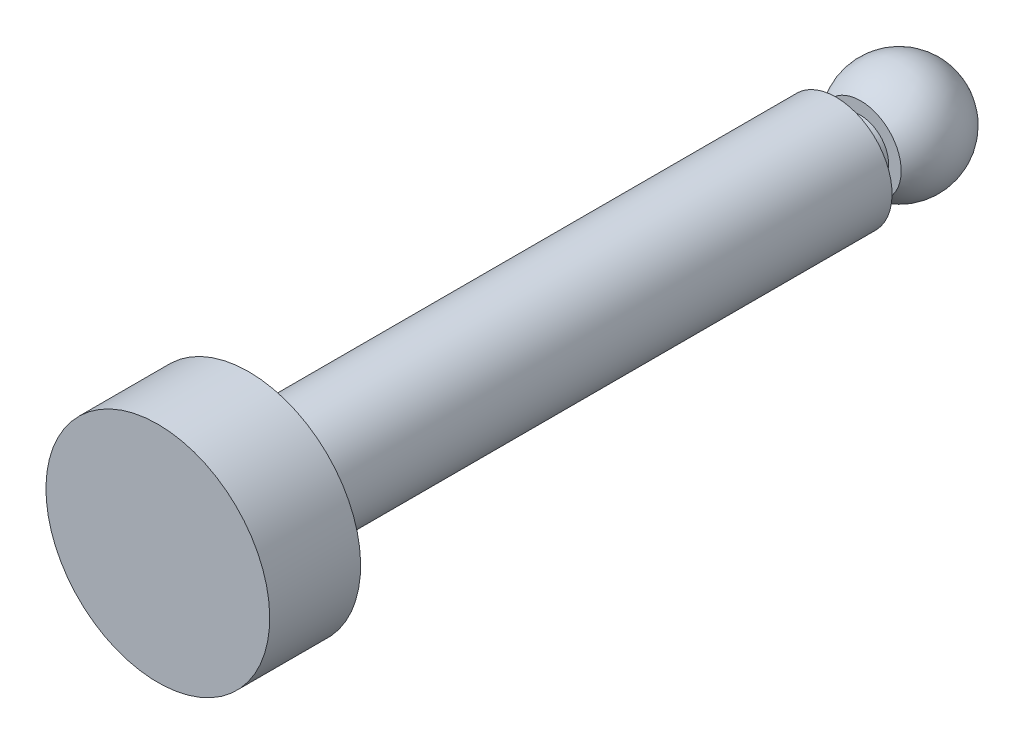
ISO-10303-21;
HEADER;
FILE_DESCRIPTION(('STEP AP214'),'2;1');
FILE_NAME('part.step','',(''),(''),'','','');
FILE_SCHEMA(('AUTOMOTIVE_DESIGN { 1 0 10303 214 1 1 1 1 }'));
ENDSEC;
DATA;
#1=APPLICATION_CONTEXT('core data for automotive mechanical design processes');
#2=APPLICATION_PROTOCOL_DEFINITION('international standard','automotive_design',2000,#1);
#3=PRODUCT_CONTEXT('',#1,'mechanical');
#4=PRODUCT('Part','Part','',(#3));
#5=PRODUCT_RELATED_PRODUCT_CATEGORY('part','',(#4));
#6=PRODUCT_DEFINITION_FORMATION('','',#4);
#7=PRODUCT_DEFINITION_CONTEXT('part definition',#1,'design');
#8=PRODUCT_DEFINITION('design','',#6,#7);
#9=PRODUCT_DEFINITION_SHAPE('','',#8);
#10=(LENGTH_UNIT() NAMED_UNIT(*) SI_UNIT(.MILLI.,.METRE.));
#11=(NAMED_UNIT(*) PLANE_ANGLE_UNIT() SI_UNIT($,.RADIAN.));
#12=(NAMED_UNIT(*) SI_UNIT($,.STERADIAN.) SOLID_ANGLE_UNIT());
#13=UNCERTAINTY_MEASURE_WITH_UNIT(LENGTH_MEASURE(1.E-05),#10,'distance_accuracy_value','');
#14=(GEOMETRIC_REPRESENTATION_CONTEXT(3) GLOBAL_UNCERTAINTY_ASSIGNED_CONTEXT((#13)) GLOBAL_UNIT_ASSIGNED_CONTEXT((#10,
#11,#12)) REPRESENTATION_CONTEXT('',''));
#15=CARTESIAN_POINT('',(0.,0.,0.));
#16=DIRECTION('',(0.,0.,1.));
#17=DIRECTION('',(1.,0.,0.));
#18=AXIS2_PLACEMENT_3D('',#15,#16,#17);
#19=CARTESIAN_POINT('',(0.,-16.,114.));
#20=DIRECTION('',(0.,0.,-1.));
#21=DIRECTION('',(0.,-1.,0.));
#22=AXIS2_PLACEMENT_3D('',#19,#20,#21);
#23=PLANE('',#22);
#24=CARTESIAN_POINT('',(0.,0.,114.));
#25=DIRECTION('',(0.,0.,1.));
#26=DIRECTION('',(0.,1.,0.));
#27=AXIS2_PLACEMENT_3D('',#24,#25,#26);
#28=CIRCLE('',#27,16.);
#29=CARTESIAN_POINT('',(0.,16.,114.));
#30=VERTEX_POINT('',#29);
#31=EDGE_CURVE('E37',#30,#30,#28,.T.);
#32=ORIENTED_EDGE('',*,*,#31,.T.);
#33=EDGE_LOOP('',(#32));
#34=FACE_BOUND('',#33,.T.);
#35=ADVANCED_FACE('F12',(#34),#23,.F.);
#36=CARTESIAN_POINT('',(0.,0.,8.));
#37=DIRECTION('',(0.,-1.,0.));
#38=DIRECTION('',(-1.,0.,0.));
#39=AXIS2_PLACEMENT_3D('',#36,#37,#38);
#40=SPHERICAL_SURFACE('',#39,8.);
#41=CARTESIAN_POINT('',(0.,0.,8.));
#42=DIRECTION('',(0.,0.,1.));
#43=DIRECTION('',(0.,1.,0.));
#44=AXIS2_PLACEMENT_3D('',#41,#42,#43);
#45=SPHERICAL_SURFACE('',#44,8.);
#46=CARTESIAN_POINT('',(0.,0.,13.5));
#47=DIRECTION('',(0.,0.,1.));
#48=DIRECTION('',(0.,1.,0.));
#49=AXIS2_PLACEMENT_3D('',#46,#47,#48);
#50=CIRCLE('',#49,5.80947501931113);
#51=CARTESIAN_POINT('',(0.,5.80947501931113,13.5));
#52=VERTEX_POINT('',#51);
#53=EDGE_CURVE('E8',#52,#52,#50,.T.);
#54=ORIENTED_EDGE('',*,*,#53,.F.);
#55=EDGE_LOOP('',(#54));
#56=FACE_BOUND('',#55,.T.);
#57=ADVANCED_FACE('F67',(#56),#45,.T.);
#58=CARTESIAN_POINT('',(0.,-5.80947501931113,13.5));
#59=DIRECTION('',(0.,0.,-1.));
#60=DIRECTION('',(0.,-1.,0.));
#61=AXIS2_PLACEMENT_3D('',#58,#59,#60);
#62=PLANE('',#61);
#63=CARTESIAN_POINT('',(0.,0.,13.5));
#64=DIRECTION('',(0.,0.,1.));
#65=DIRECTION('',(0.,1.,0.));
#66=AXIS2_PLACEMENT_3D('',#63,#64,#65);
#67=CIRCLE('',#66,4.);
#68=CARTESIAN_POINT('',(0.,4.,13.5));
#69=VERTEX_POINT('',#68);
#70=EDGE_CURVE('E18',#69,#69,#67,.T.);
#71=ORIENTED_EDGE('',*,*,#70,.F.);
#72=EDGE_LOOP('',(#71));
#73=FACE_BOUND('',#72,.T.);
#74=ORIENTED_EDGE('',*,*,#53,.T.);
#75=EDGE_LOOP('',(#74));
#76=FACE_BOUND('',#75,.T.);
#77=ADVANCED_FACE('F71',(#73,#76),#62,.F.);
#78=CARTESIAN_POINT('',(0.,0.,8.3));
#79=DIRECTION('',(0.,0.,1.));
#80=DIRECTION('',(0.,1.,0.));
#81=AXIS2_PLACEMENT_3D('',#78,#79,#80);
#82=CYLINDRICAL_SURFACE('',#81,4.);
#83=ORIENTED_EDGE('',*,*,#70,.T.);
#84=EDGE_LOOP('',(#83));
#85=FACE_BOUND('',#84,.T.);
#86=CARTESIAN_POINT('',(0.,0.,17.));
#87=DIRECTION('',(0.,0.,1.));
#88=DIRECTION('',(0.,1.,0.));
#89=AXIS2_PLACEMENT_3D('',#86,#87,#88);
#90=CIRCLE('',#89,4.);
#91=CARTESIAN_POINT('',(0.,4.,17.));
#92=VERTEX_POINT('',#91);
#93=EDGE_CURVE('E22',#92,#92,#90,.T.);
#94=ORIENTED_EDGE('',*,*,#93,.F.);
#95=EDGE_LOOP('',(#94));
#96=FACE_BOUND('',#95,.T.);
#97=ADVANCED_FACE('F63',(#85,#96),#82,.T.);
#98=CARTESIAN_POINT('',(0.,-8.,17.));
#99=DIRECTION('',(0.,0.,-1.));
#100=DIRECTION('',(0.,-1.,0.));
#101=AXIS2_PLACEMENT_3D('',#98,#99,#100);
#102=PLANE('',#101);
#103=ORIENTED_EDGE('',*,*,#93,.T.);
#104=EDGE_LOOP('',(#103));
#105=FACE_BOUND('',#104,.T.);
#106=CARTESIAN_POINT('',(0.,0.,17.));
#107=DIRECTION('',(0.,0.,1.));
#108=DIRECTION('',(0.,1.,0.));
#109=AXIS2_PLACEMENT_3D('',#106,#107,#108);
#110=CIRCLE('',#109,8.);
#111=CARTESIAN_POINT('',(0.,8.,17.));
#112=VERTEX_POINT('',#111);
#113=EDGE_CURVE('E26',#112,#112,#110,.T.);
#114=ORIENTED_EDGE('',*,*,#113,.F.);
#115=EDGE_LOOP('',(#114));
#116=FACE_BOUND('',#115,.T.);
#117=ADVANCED_FACE('F56',(#105,#116),#102,.T.);
#118=CARTESIAN_POINT('',(0.,0.,8.3));
#119=DIRECTION('',(0.,0.,1.));
#120=DIRECTION('',(0.,1.,0.));
#121=AXIS2_PLACEMENT_3D('',#118,#119,#120);
#122=CYLINDRICAL_SURFACE('',#121,8.);
#123=ORIENTED_EDGE('',*,*,#113,.T.);
#124=EDGE_LOOP('',(#123));
#125=FACE_BOUND('',#124,.T.);
#126=CARTESIAN_POINT('',(0.,0.,101.));
#127=DIRECTION('',(0.,0.,1.));
#128=DIRECTION('',(0.,1.,0.));
#129=AXIS2_PLACEMENT_3D('',#126,#127,#128);
#130=CIRCLE('',#129,8.);
#131=CARTESIAN_POINT('',(0.,8.,101.));
#132=VERTEX_POINT('',#131);
#133=EDGE_CURVE('E31',#132,#132,#130,.T.);
#134=ORIENTED_EDGE('',*,*,#133,.F.);
#135=EDGE_LOOP('',(#134));
#136=FACE_BOUND('',#135,.T.);
#137=ADVANCED_FACE('F51',(#125,#136),#122,.T.);
#138=CARTESIAN_POINT('',(0.,-8.,101.));
#139=DIRECTION('',(0.,0.,1.));
#140=DIRECTION('',(0.,1.,0.));
#141=AXIS2_PLACEMENT_3D('',#138,#139,#140);
#142=PLANE('',#141);
#143=CARTESIAN_POINT('',(0.,0.,101.));
#144=DIRECTION('',(0.,0.,1.));
#145=DIRECTION('',(0.,1.,0.));
#146=AXIS2_PLACEMENT_3D('',#143,#144,#145);
#147=CIRCLE('',#146,16.);
#148=CARTESIAN_POINT('',(0.,16.,101.));
#149=VERTEX_POINT('',#148);
#150=EDGE_CURVE('E34',#149,#149,#147,.T.);
#151=ORIENTED_EDGE('',*,*,#150,.F.);
#152=EDGE_LOOP('',(#151));
#153=FACE_BOUND('',#152,.T.);
#154=ORIENTED_EDGE('',*,*,#133,.T.);
#155=EDGE_LOOP('',(#154));
#156=FACE_BOUND('',#155,.T.);
#157=ADVANCED_FACE('F45',(#153,#156),#142,.F.);
#158=CARTESIAN_POINT('',(0.,0.,8.3));
#159=DIRECTION('',(0.,0.,1.));
#160=DIRECTION('',(0.,1.,0.));
#161=AXIS2_PLACEMENT_3D('',#158,#159,#160);
#162=CYLINDRICAL_SURFACE('',#161,16.);
#163=ORIENTED_EDGE('',*,*,#31,.F.);
#164=EDGE_LOOP('',(#163));
#165=FACE_BOUND('',#164,.T.);
#166=ORIENTED_EDGE('',*,*,#150,.T.);
#167=EDGE_LOOP('',(#166));
#168=FACE_BOUND('',#167,.T.);
#169=ADVANCED_FACE('F42',(#165,#168),#162,.T.);
#170=CLOSED_SHELL('',(#35,#57,#77,#97,#117,#137,#157,#169));
#171=MANIFOLD_SOLID_BREP('B1',#170);
#172=ADVANCED_BREP_SHAPE_REPRESENTATION('',(#18,#171),#14);
#173=SHAPE_DEFINITION_REPRESENTATION(#9,#172);
ENDSEC;
END-ISO-10303-21;
